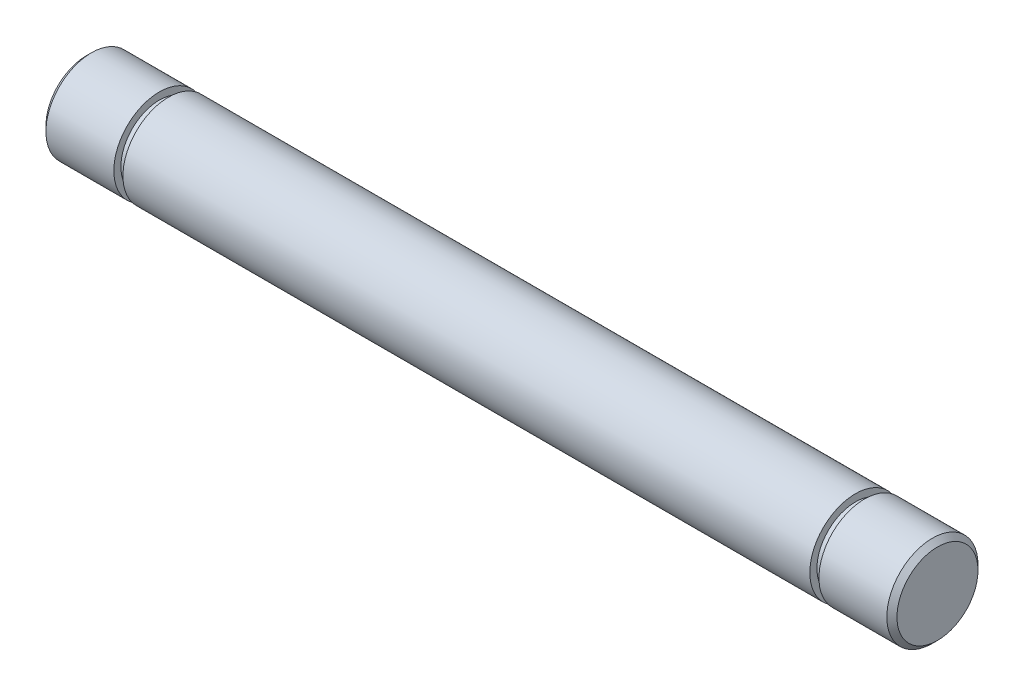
ISO-10303-21;
HEADER;
FILE_DESCRIPTION(('STEP AP214'),'2;1');
FILE_NAME('part.step','',(''),(''),'','','');
FILE_SCHEMA(('AUTOMOTIVE_DESIGN { 1 0 10303 214 1 1 1 1 }'));
ENDSEC;
DATA;
#1=APPLICATION_CONTEXT('core data for automotive mechanical design processes');
#2=APPLICATION_PROTOCOL_DEFINITION('international standard','automotive_design',2000,#1);
#3=PRODUCT_CONTEXT('',#1,'mechanical');
#4=PRODUCT('Part','Part','',(#3));
#5=PRODUCT_RELATED_PRODUCT_CATEGORY('part','',(#4));
#6=PRODUCT_DEFINITION_FORMATION('','',#4);
#7=PRODUCT_DEFINITION_CONTEXT('part definition',#1,'design');
#8=PRODUCT_DEFINITION('design','',#6,#7);
#9=PRODUCT_DEFINITION_SHAPE('','',#8);
#10=(LENGTH_UNIT() NAMED_UNIT(*) SI_UNIT(.MILLI.,.METRE.));
#11=(NAMED_UNIT(*) PLANE_ANGLE_UNIT() SI_UNIT($,.RADIAN.));
#12=(NAMED_UNIT(*) SI_UNIT($,.STERADIAN.) SOLID_ANGLE_UNIT());
#13=UNCERTAINTY_MEASURE_WITH_UNIT(LENGTH_MEASURE(1.E-05),#10,'distance_accuracy_value','');
#14=(GEOMETRIC_REPRESENTATION_CONTEXT(3) GLOBAL_UNCERTAINTY_ASSIGNED_CONTEXT((#13)) GLOBAL_UNIT_ASSIGNED_CONTEXT((#10,
#11,#12)) REPRESENTATION_CONTEXT('',''));
#15=CARTESIAN_POINT('',(0.,0.,0.));
#16=DIRECTION('',(0.,0.,1.));
#17=DIRECTION('',(1.,0.,0.));
#18=AXIS2_PLACEMENT_3D('',#15,#16,#17);
#19=CARTESIAN_POINT('',(0.,0.,0.));
#20=DIRECTION('',(-1.,0.,0.));
#21=DIRECTION('',(0.,0.,1.));
#22=AXIS2_PLACEMENT_3D('',#19,#20,#21);
#23=PLANE('',#22);
#24=CARTESIAN_POINT('',(0.,0.,0.));
#25=DIRECTION('',(1.,0.,0.));
#26=DIRECTION('',(0.,0.,-1.));
#27=AXIS2_PLACEMENT_3D('',#24,#25,#26);
#28=CIRCLE('',#27,3.99999999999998);
#29=CARTESIAN_POINT('',(0.,0.,-3.99999999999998));
#30=VERTEX_POINT('',#29);
#31=EDGE_CURVE('E10',#30,#30,#28,.T.);
#32=ORIENTED_EDGE('',*,*,#31,.F.);
#33=EDGE_LOOP('',(#32));
#34=FACE_BOUND('',#33,.T.);
#35=ADVANCED_FACE('F28',(#34),#23,.T.);
#36=CARTESIAN_POINT('',(0.5,0.,0.));
#37=DIRECTION('',(1.,0.,0.));
#38=DIRECTION('',(0.,0.,-1.));
#39=AXIS2_PLACEMENT_3D('',#36,#37,#38);
#40=CONICAL_SURFACE('',#39,4.49999999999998,0.785398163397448);
#41=ORIENTED_EDGE('',*,*,#31,.T.);
#42=EDGE_LOOP('',(#41));
#43=FACE_BOUND('',#42,.T.);
#44=CARTESIAN_POINT('',(0.5,0.,0.));
#45=DIRECTION('',(1.,0.,0.));
#46=DIRECTION('',(0.,0.,-1.));
#47=AXIS2_PLACEMENT_3D('',#44,#45,#46);
#48=CIRCLE('',#47,4.49999999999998);
#49=CARTESIAN_POINT('',(0.5,0.,-4.49999999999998));
#50=VERTEX_POINT('',#49);
#51=EDGE_CURVE('E34',#50,#50,#48,.T.);
#52=ORIENTED_EDGE('',*,*,#51,.F.);
#53=EDGE_LOOP('',(#52));
#54=FACE_BOUND('',#53,.T.);
#55=ADVANCED_FACE('F88',(#43,#54),#40,.T.);
#56=CARTESIAN_POINT('',(124.297135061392,0.,0.));
#57=DIRECTION('',(1.,0.,0.));
#58=DIRECTION('',(0.,0.,-1.));
#59=AXIS2_PLACEMENT_3D('',#56,#57,#58);
#60=CYLINDRICAL_SURFACE('',#59,4.49999999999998);
#61=ORIENTED_EDGE('',*,*,#51,.T.);
#62=EDGE_LOOP('',(#61));
#63=FACE_BOUND('',#62,.T.);
#64=CARTESIAN_POINT('',(7.2,0.,0.));
#65=DIRECTION('',(1.,0.,0.));
#66=DIRECTION('',(0.,0.,-1.));
#67=AXIS2_PLACEMENT_3D('',#64,#65,#66);
#68=CIRCLE('',#67,4.49999999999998);
#69=CARTESIAN_POINT('',(7.2,0.,-4.49999999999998));
#70=VERTEX_POINT('',#69);
#71=EDGE_CURVE('E38',#70,#70,#68,.T.);
#72=ORIENTED_EDGE('',*,*,#71,.F.);
#73=EDGE_LOOP('',(#72));
#74=FACE_BOUND('',#73,.T.);
#75=ADVANCED_FACE('F93',(#63,#74),#60,.T.);
#76=CARTESIAN_POINT('',(7.2,4.49999999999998,0.));
#77=DIRECTION('',(1.,0.,0.));
#78=DIRECTION('',(0.,0.,-1.));
#79=AXIS2_PLACEMENT_3D('',#76,#77,#78);
#80=PLANE('',#79);
#81=ORIENTED_EDGE('',*,*,#71,.T.);
#82=EDGE_LOOP('',(#81));
#83=FACE_BOUND('',#82,.T.);
#84=CARTESIAN_POINT('',(7.2,0.,0.));
#85=DIRECTION('',(1.,0.,0.));
#86=DIRECTION('',(0.,0.,-1.));
#87=AXIS2_PLACEMENT_3D('',#84,#85,#86);
#88=CIRCLE('',#87,3.79999999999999);
#89=CARTESIAN_POINT('',(7.2,0.,-3.79999999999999));
#90=VERTEX_POINT('',#89);
#91=EDGE_CURVE('E42',#90,#90,#88,.T.);
#92=ORIENTED_EDGE('',*,*,#91,.F.);
#93=EDGE_LOOP('',(#92));
#94=FACE_BOUND('',#93,.T.);
#95=ADVANCED_FACE('F97',(#83,#94),#80,.T.);
#96=CARTESIAN_POINT('',(124.297135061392,0.,0.));
#97=DIRECTION('',(1.,0.,0.));
#98=DIRECTION('',(0.,0.,-1.));
#99=AXIS2_PLACEMENT_3D('',#96,#97,#98);
#100=CYLINDRICAL_SURFACE('',#99,3.79999999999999);
#101=ORIENTED_EDGE('',*,*,#91,.T.);
#102=EDGE_LOOP('',(#101));
#103=FACE_BOUND('',#102,.T.);
#104=CARTESIAN_POINT('',(8.1,0.,0.));
#105=DIRECTION('',(1.,0.,0.));
#106=DIRECTION('',(0.,0.,-1.));
#107=AXIS2_PLACEMENT_3D('',#104,#105,#106);
#108=CIRCLE('',#107,3.79999999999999);
#109=CARTESIAN_POINT('',(8.1,0.,-3.79999999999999));
#110=VERTEX_POINT('',#109);
#111=EDGE_CURVE('E47',#110,#110,#108,.T.);
#112=ORIENTED_EDGE('',*,*,#111,.F.);
#113=EDGE_LOOP('',(#112));
#114=FACE_BOUND('',#113,.T.);
#115=ADVANCED_FACE('F103',(#103,#114),#100,.T.);
#116=CARTESIAN_POINT('',(8.1,4.49999999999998,0.));
#117=DIRECTION('',(-1.,0.,0.));
#118=DIRECTION('',(0.,0.,1.));
#119=AXIS2_PLACEMENT_3D('',#116,#117,#118);
#120=PLANE('',#119);
#121=ORIENTED_EDGE('',*,*,#111,.T.);
#122=EDGE_LOOP('',(#121));
#123=FACE_BOUND('',#122,.T.);
#124=CARTESIAN_POINT('',(8.1,0.,0.));
#125=DIRECTION('',(1.,0.,0.));
#126=DIRECTION('',(0.,0.,-1.));
#127=AXIS2_PLACEMENT_3D('',#124,#125,#126);
#128=CIRCLE('',#127,4.49999999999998);
#129=CARTESIAN_POINT('',(8.1,0.,-4.49999999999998));
#130=VERTEX_POINT('',#129);
#131=EDGE_CURVE('E50',#130,#130,#128,.T.);
#132=ORIENTED_EDGE('',*,*,#131,.F.);
#133=EDGE_LOOP('',(#132));
#134=FACE_BOUND('',#133,.T.);
#135=ADVANCED_FACE('F107',(#123,#134),#120,.T.);
#136=CARTESIAN_POINT('',(124.297135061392,0.,0.));
#137=DIRECTION('',(1.,0.,0.));
#138=DIRECTION('',(0.,0.,-1.));
#139=AXIS2_PLACEMENT_3D('',#136,#137,#138);
#140=CYLINDRICAL_SURFACE('',#139,4.49999999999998);
#141=ORIENTED_EDGE('',*,*,#131,.T.);
#142=EDGE_LOOP('',(#141));
#143=FACE_BOUND('',#142,.T.);
#144=CARTESIAN_POINT('',(75.9,0.,0.));
#145=DIRECTION('',(1.,0.,0.));
#146=DIRECTION('',(0.,0.,-1.));
#147=AXIS2_PLACEMENT_3D('',#144,#145,#146);
#148=CIRCLE('',#147,4.49999999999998);
#149=CARTESIAN_POINT('',(75.9,0.,-4.49999999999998));
#150=VERTEX_POINT('',#149);
#151=EDGE_CURVE('E53',#150,#150,#148,.T.);
#152=ORIENTED_EDGE('',*,*,#151,.F.);
#153=EDGE_LOOP('',(#152));
#154=FACE_BOUND('',#153,.T.);
#155=ADVANCED_FACE('F111',(#143,#154),#140,.T.);
#156=CARTESIAN_POINT('',(75.9,4.49999999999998,0.));
#157=DIRECTION('',(1.,0.,0.));
#158=DIRECTION('',(0.,0.,-1.));
#159=AXIS2_PLACEMENT_3D('',#156,#157,#158);
#160=PLANE('',#159);
#161=ORIENTED_EDGE('',*,*,#151,.T.);
#162=EDGE_LOOP('',(#161));
#163=FACE_BOUND('',#162,.T.);
#164=CARTESIAN_POINT('',(75.9,0.,0.));
#165=DIRECTION('',(1.,0.,0.));
#166=DIRECTION('',(0.,0.,-1.));
#167=AXIS2_PLACEMENT_3D('',#164,#165,#166);
#168=CIRCLE('',#167,3.79999999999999);
#169=CARTESIAN_POINT('',(75.9,0.,-3.79999999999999));
#170=VERTEX_POINT('',#169);
#171=EDGE_CURVE('E56',#170,#170,#168,.T.);
#172=ORIENTED_EDGE('',*,*,#171,.F.);
#173=EDGE_LOOP('',(#172));
#174=FACE_BOUND('',#173,.T.);
#175=ADVANCED_FACE('F115',(#163,#174),#160,.T.);
#176=CARTESIAN_POINT('',(124.297135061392,0.,0.));
#177=DIRECTION('',(1.,0.,0.));
#178=DIRECTION('',(0.,0.,-1.));
#179=AXIS2_PLACEMENT_3D('',#176,#177,#178);
#180=CYLINDRICAL_SURFACE('',#179,3.79999999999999);
#181=ORIENTED_EDGE('',*,*,#171,.T.);
#182=EDGE_LOOP('',(#181));
#183=FACE_BOUND('',#182,.T.);
#184=CARTESIAN_POINT('',(76.8,0.,0.));
#185=DIRECTION('',(1.,0.,0.));
#186=DIRECTION('',(0.,0.,-1.));
#187=AXIS2_PLACEMENT_3D('',#184,#185,#186);
#188=CIRCLE('',#187,3.79999999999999);
#189=CARTESIAN_POINT('',(76.8,0.,-3.79999999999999));
#190=VERTEX_POINT('',#189);
#191=EDGE_CURVE('E59',#190,#190,#188,.T.);
#192=ORIENTED_EDGE('',*,*,#191,.F.);
#193=EDGE_LOOP('',(#192));
#194=FACE_BOUND('',#193,.T.);
#195=ADVANCED_FACE('F119',(#183,#194),#180,.T.);
#196=CARTESIAN_POINT('',(76.8,4.49999999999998,0.));
#197=DIRECTION('',(-1.,0.,0.));
#198=DIRECTION('',(0.,0.,1.));
#199=AXIS2_PLACEMENT_3D('',#196,#197,#198);
#200=PLANE('',#199);
#201=ORIENTED_EDGE('',*,*,#191,.T.);
#202=EDGE_LOOP('',(#201));
#203=FACE_BOUND('',#202,.T.);
#204=CARTESIAN_POINT('',(76.8,0.,0.));
#205=DIRECTION('',(1.,0.,0.));
#206=DIRECTION('',(0.,0.,-1.));
#207=AXIS2_PLACEMENT_3D('',#204,#205,#206);
#208=CIRCLE('',#207,4.49999999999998);
#209=CARTESIAN_POINT('',(76.8,0.,-4.49999999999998));
#210=VERTEX_POINT('',#209);
#211=EDGE_CURVE('E62',#210,#210,#208,.T.);
#212=ORIENTED_EDGE('',*,*,#211,.F.);
#213=EDGE_LOOP('',(#212));
#214=FACE_BOUND('',#213,.T.);
#215=ADVANCED_FACE('F84',(#203,#214),#200,.T.);
#216=CARTESIAN_POINT('',(124.297135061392,0.,0.));
#217=DIRECTION('',(1.,0.,0.));
#218=DIRECTION('',(0.,0.,-1.));
#219=AXIS2_PLACEMENT_3D('',#216,#217,#218);
#220=CYLINDRICAL_SURFACE('',#219,4.49999999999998);
#221=ORIENTED_EDGE('',*,*,#211,.T.);
#222=EDGE_LOOP('',(#221));
#223=FACE_BOUND('',#222,.T.);
#224=CARTESIAN_POINT('',(83.5,0.,0.));
#225=DIRECTION('',(1.,0.,0.));
#226=DIRECTION('',(0.,0.,-1.));
#227=AXIS2_PLACEMENT_3D('',#224,#225,#226);
#228=CIRCLE('',#227,4.49999999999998);
#229=CARTESIAN_POINT('',(83.5,0.,-4.49999999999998));
#230=VERTEX_POINT('',#229);
#231=EDGE_CURVE('E65',#230,#230,#228,.T.);
#232=ORIENTED_EDGE('',*,*,#231,.F.);
#233=EDGE_LOOP('',(#232));
#234=FACE_BOUND('',#233,.T.);
#235=ADVANCED_FACE('F76',(#223,#234),#220,.T.);
#236=CARTESIAN_POINT('',(84.,0.,0.));
#237=DIRECTION('',(-1.,0.,0.));
#238=DIRECTION('',(0.,0.,1.));
#239=AXIS2_PLACEMENT_3D('',#236,#237,#238);
#240=CONICAL_SURFACE('',#239,3.99999999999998,0.785398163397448);
#241=ORIENTED_EDGE('',*,*,#231,.T.);
#242=EDGE_LOOP('',(#241));
#243=FACE_BOUND('',#242,.T.);
#244=CARTESIAN_POINT('',(84.,0.,0.));
#245=DIRECTION('',(1.,0.,0.));
#246=DIRECTION('',(0.,0.,-1.));
#247=AXIS2_PLACEMENT_3D('',#244,#245,#246);
#248=CIRCLE('',#247,3.99999999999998);
#249=CARTESIAN_POINT('',(84.,0.,-3.99999999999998));
#250=VERTEX_POINT('',#249);
#251=EDGE_CURVE('E68',#250,#250,#248,.T.);
#252=ORIENTED_EDGE('',*,*,#251,.F.);
#253=EDGE_LOOP('',(#252));
#254=FACE_BOUND('',#253,.T.);
#255=ADVANCED_FACE('F74',(#243,#254),#240,.T.);
#256=CARTESIAN_POINT('',(84.,0.,0.));
#257=DIRECTION('',(1.,0.,0.));
#258=DIRECTION('',(0.,0.,-1.));
#259=AXIS2_PLACEMENT_3D('',#256,#257,#258);
#260=PLANE('',#259);
#261=ORIENTED_EDGE('',*,*,#251,.T.);
#262=EDGE_LOOP('',(#261));
#263=FACE_BOUND('',#262,.T.);
#264=ADVANCED_FACE('F72',(#263),#260,.T.);
#265=CLOSED_SHELL('',(#35,#55,#75,#95,#115,#135,#155,#175,#195,#215,#235,#255,#264));
#266=MANIFOLD_SOLID_BREP('B2',#265);
#267=ADVANCED_BREP_SHAPE_REPRESENTATION('',(#18,#266),#14);
#268=SHAPE_DEFINITION_REPRESENTATION(#9,#267);
ENDSEC;
END-ISO-10303-21;
